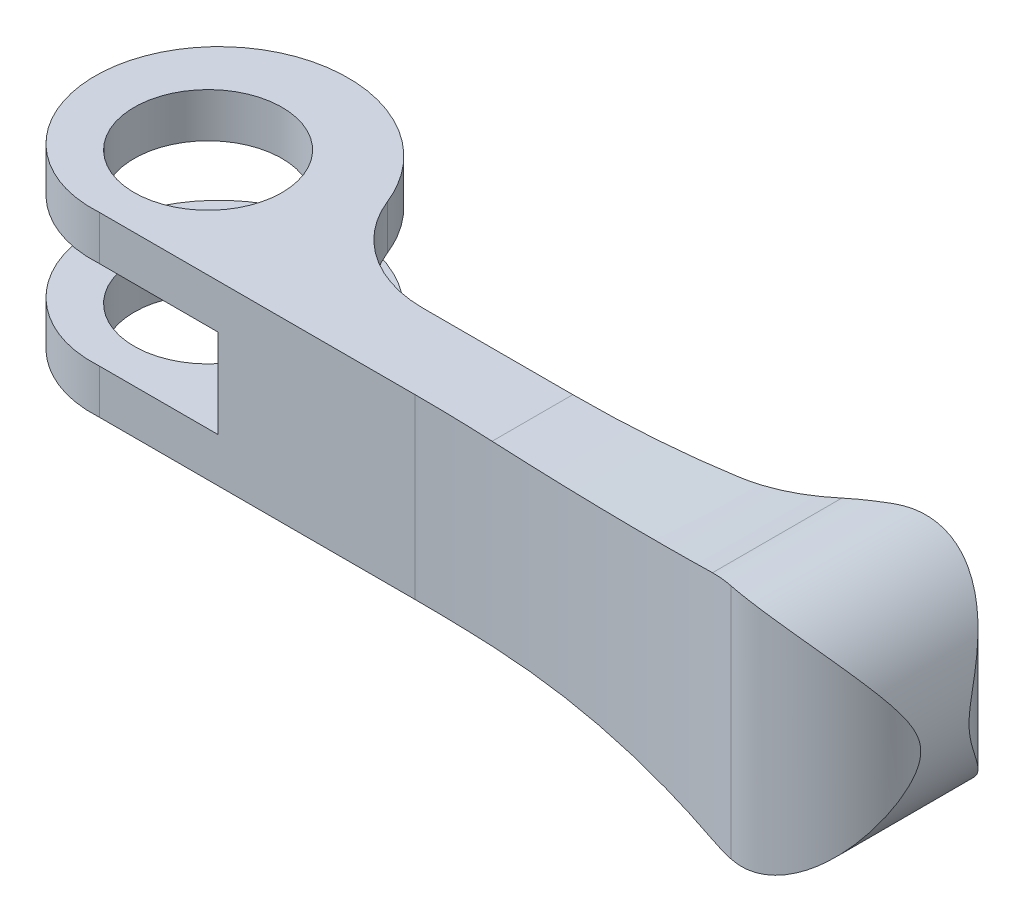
ISO-10303-21;
HEADER;
FILE_DESCRIPTION(('STEP AP214'),'2;1');
FILE_NAME('part.step','',(''),(''),'','','');
FILE_SCHEMA(('AUTOMOTIVE_DESIGN { 1 0 10303 214 1 1 1 1 }'));
ENDSEC;
DATA;
#1=APPLICATION_CONTEXT('core data for automotive mechanical design processes');
#2=APPLICATION_PROTOCOL_DEFINITION('international standard','automotive_design',2000,#1);
#3=PRODUCT_CONTEXT('',#1,'mechanical');
#4=PRODUCT('Part','Part','',(#3));
#5=PRODUCT_RELATED_PRODUCT_CATEGORY('part','',(#4));
#6=PRODUCT_DEFINITION_FORMATION('','',#4);
#7=PRODUCT_DEFINITION_CONTEXT('part definition',#1,'design');
#8=PRODUCT_DEFINITION('design','',#6,#7);
#9=PRODUCT_DEFINITION_SHAPE('','',#8);
#10=(LENGTH_UNIT() NAMED_UNIT(*) SI_UNIT(.MILLI.,.METRE.));
#11=(NAMED_UNIT(*) PLANE_ANGLE_UNIT() SI_UNIT($,.RADIAN.));
#12=(NAMED_UNIT(*) SI_UNIT($,.STERADIAN.) SOLID_ANGLE_UNIT());
#13=UNCERTAINTY_MEASURE_WITH_UNIT(LENGTH_MEASURE(1.E-05),#10,'distance_accuracy_value','');
#14=(GEOMETRIC_REPRESENTATION_CONTEXT(3) GLOBAL_UNCERTAINTY_ASSIGNED_CONTEXT((#13)) GLOBAL_UNIT_ASSIGNED_CONTEXT((#10,
#11,#12)) REPRESENTATION_CONTEXT('',''));
#15=CARTESIAN_POINT('',(0.,0.,0.));
#16=DIRECTION('',(0.,0.,1.));
#17=DIRECTION('',(1.,0.,0.));
#18=AXIS2_PLACEMENT_3D('',#15,#16,#17);
#19=CARTESIAN_POINT('',(32.,-12.,183.));
#20=DIRECTION('',(0.,1.,0.));
#21=DIRECTION('',(1.,0.,0.));
#22=AXIS2_PLACEMENT_3D('',#19,#20,#21);
#23=CYLINDRICAL_SURFACE('',#22,172.);
#24=CARTESIAN_POINT('',(65.4577553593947,11.7276166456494,14.2855115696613));
#25=CARTESIAN_POINT('',(65.6518253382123,11.7696913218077,14.3239954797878));
#26=CARTESIAN_POINT('',(65.8468221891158,11.8069140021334,14.3630148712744));
#27=CARTESIAN_POINT('',(66.2377621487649,11.8715471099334,14.4419534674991));
#28=CARTESIAN_POINT('',(66.4337019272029,11.8989805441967,14.4818703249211));
#29=CARTESIAN_POINT('',(67.0233117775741,11.9667391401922,14.6030598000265));
#30=CARTESIAN_POINT('',(67.4184272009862,11.9924480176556,14.6857029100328));
#31=CARTESIAN_POINT('',(67.813698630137,11.9985537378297,14.7698630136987));
#32=B_SPLINE_CURVE_WITH_KNOTS('',3,(#24,#25,#26,#27,#28,#29,#30,#31),.UNSPECIFIED.,.F.,.F.,(4,2,
2,4),(0.,0.606723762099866,1.2120120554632,2.42366281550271),.UNSPECIFIED.);
#33=CARTESIAN_POINT('',(65.4577553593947,11.7276166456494,14.2855115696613));
#34=VERTEX_POINT('',#33);
#35=CARTESIAN_POINT('',(67.813698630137,11.9985537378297,14.7698630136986));
#36=VERTEX_POINT('',#35);
#37=EDGE_CURVE('E179',#34,#36,#32,.T.);
#38=ORIENTED_EDGE('',*,*,#37,.F.);
#39=CARTESIAN_POINT('',(40.,9.,11.1861472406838));
#40=CARTESIAN_POINT('',(41.0786495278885,8.99998998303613,11.236360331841));
#41=CARTESIAN_POINT('',(42.1568138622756,9.01452328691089,11.2967523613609));
#42=CARTESIAN_POINT('',(44.3110259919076,9.07252358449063,11.4377582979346));
#43=CARTESIAN_POINT('',(45.3870738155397,9.11599018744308,11.5183719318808));
#44=CARTESIAN_POINT('',(47.5315233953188,9.2314665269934,11.6993141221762));
#45=CARTESIAN_POINT('',(48.5999384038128,9.30335830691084,11.7995603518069));
#46=CARTESIAN_POINT('',(50.7323922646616,9.47544657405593,12.0197470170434));
#47=CARTESIAN_POINT('',(51.7964311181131,9.57564305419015,12.1396874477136));
#48=CARTESIAN_POINT('',(54.9804202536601,9.91831356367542,12.5286842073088));
#49=CARTESIAN_POINT('',(57.0925861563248,10.2028872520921,12.8269450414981));
#50=CARTESIAN_POINT('',(60.2423967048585,10.7124052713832,13.3311883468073));
#51=CARTESIAN_POINT('',(61.2914624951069,10.8964990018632,13.50918245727));
#52=CARTESIAN_POINT('',(63.3811325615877,11.2918145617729,13.8836170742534));
#53=CARTESIAN_POINT('',(64.4217370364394,11.5030357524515,14.0800571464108));
#54=CARTESIAN_POINT('',(65.4577553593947,11.7276166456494,14.2855115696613));
#55=B_SPLINE_CURVE_WITH_KNOTS('',3,(#39,#40,#41,#42,#43,#44,#45,#46,#47,#48,#49,#50,#51,#52,#53,
#54),.UNSPECIFIED.,.F.,.F.,(4,2,2,2,2,2,2,4),(0.,3.23928692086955,6.47853009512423,
9.70447004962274,12.9304091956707,19.3812550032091,22.6204269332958,25.8595226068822),.UNSPECIFIED.);
#56=CARTESIAN_POINT('',(40.,9.,11.1861472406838));
#57=VERTEX_POINT('',#56);
#58=EDGE_CURVE('E145',#57,#34,#55,.T.);
#59=ORIENTED_EDGE('',*,*,#58,.F.);
#60=CARTESIAN_POINT('',(32.,9.,183.));
#61=DIRECTION('',(0.,1.,0.));
#62=DIRECTION('',(1.,0.,0.));
#63=AXIS2_PLACEMENT_3D('',#60,#61,#62);
#64=CIRCLE('',#63,172.);
#65=CARTESIAN_POINT('',(32.,9.,11.));
#66=VERTEX_POINT('',#65);
#67=EDGE_CURVE('E154',#66,#57,#64,.F.);
#68=ORIENTED_EDGE('',*,*,#67,.F.);
#69=DIRECTION('',(0.,1.,0.));
#70=VECTOR('',#69,1.);
#71=CARTESIAN_POINT('',(32.,-12.,11.));
#72=LINE('',#71,#70);
#73=CARTESIAN_POINT('',(32.,-9.,11.));
#74=VERTEX_POINT('',#73);
#75=EDGE_CURVE('E301',#74,#66,#72,.T.);
#76=ORIENTED_EDGE('',*,*,#75,.F.);
#77=CARTESIAN_POINT('',(32.,-9.,183.));
#78=DIRECTION('',(0.,1.,0.));
#79=DIRECTION('',(1.,0.,0.));
#80=AXIS2_PLACEMENT_3D('',#77,#78,#79);
#81=CIRCLE('',#80,172.);
#82=CARTESIAN_POINT('',(40.,-9.,11.1861472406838));
#83=VERTEX_POINT('',#82);
#84=EDGE_CURVE('E522',#74,#83,#81,.F.);
#85=ORIENTED_EDGE('',*,*,#84,.T.);
#86=CARTESIAN_POINT('',(40.,-9.,11.1861472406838));
#87=CARTESIAN_POINT('',(41.0786495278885,-8.99998998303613,11.236360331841));
#88=CARTESIAN_POINT('',(42.1568138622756,-9.01452328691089,11.2967523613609));
#89=CARTESIAN_POINT('',(44.3110259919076,-9.07252358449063,11.4377582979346));
#90=CARTESIAN_POINT('',(45.3870738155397,-9.11599018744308,11.5183719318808));
#91=CARTESIAN_POINT('',(47.5315233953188,-9.2314665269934,11.6993141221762));
#92=CARTESIAN_POINT('',(48.5999384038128,-9.30335830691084,11.7995603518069));
#93=CARTESIAN_POINT('',(50.7323922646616,-9.47544657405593,12.0197470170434));
#94=CARTESIAN_POINT('',(51.7964311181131,-9.57564305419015,12.1396874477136));
#95=CARTESIAN_POINT('',(54.9804202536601,-9.91831356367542,12.5286842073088));
#96=CARTESIAN_POINT('',(57.0925861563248,-10.2028872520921,12.8269450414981));
#97=CARTESIAN_POINT('',(60.2423967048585,-10.7124052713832,13.3311883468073));
#98=CARTESIAN_POINT('',(61.2914624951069,-10.8964990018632,13.50918245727));
#99=CARTESIAN_POINT('',(63.3811325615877,-11.2918145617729,13.8836170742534));
#100=CARTESIAN_POINT('',(64.4217370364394,-11.5030357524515,14.0800571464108));
#101=CARTESIAN_POINT('',(65.4577553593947,-11.7276166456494,14.2855115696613));
#102=B_SPLINE_CURVE_WITH_KNOTS('',3,(#86,#87,#88,#89,#90,#91,#92,#93,#94,#95,#96,#97,#98,#99,
#100,#101),.UNSPECIFIED.,.F.,.F.,(4,2,2,2,2,2,2,4),(0.,3.23928692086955,6.47853009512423,
9.70447004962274,12.9304091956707,19.3812550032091,22.6204269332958,25.8595226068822),.UNSPECIFIED.);
#103=CARTESIAN_POINT('',(65.4577553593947,-11.7276166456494,14.2855115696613));
#104=VERTEX_POINT('',#103);
#105=EDGE_CURVE('E516',#83,#104,#102,.T.);
#106=ORIENTED_EDGE('',*,*,#105,.T.);
#107=CARTESIAN_POINT('',(65.4577553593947,-11.7276166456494,14.2855115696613));
#108=CARTESIAN_POINT('',(65.6518253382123,-11.7696913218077,14.3239954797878));
#109=CARTESIAN_POINT('',(65.8468221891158,-11.8069140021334,14.3630148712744));
#110=CARTESIAN_POINT('',(66.2377621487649,-11.8715471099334,14.4419534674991));
#111=CARTESIAN_POINT('',(66.4337019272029,-11.8989805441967,14.4818703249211));
#112=CARTESIAN_POINT('',(67.0233117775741,-11.9667391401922,14.6030598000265));
#113=CARTESIAN_POINT('',(67.4184272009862,-11.9924480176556,14.6857029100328));
#114=CARTESIAN_POINT('',(67.813698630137,-11.9985537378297,14.7698630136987));
#115=B_SPLINE_CURVE_WITH_KNOTS('',3,(#107,#108,#109,#110,#111,#112,#113,#114),.UNSPECIFIED.,.F.,
.F.,(4,2,2,4),(0.,0.606723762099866,1.2120120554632,2.42366281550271),.UNSPECIFIED.);
#116=CARTESIAN_POINT('',(67.813698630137,-11.9985537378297,14.7698630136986));
#117=VERTEX_POINT('',#116);
#118=EDGE_CURVE('E222',#104,#117,#115,.T.);
#119=ORIENTED_EDGE('',*,*,#118,.T.);
#120=DIRECTION('',(0.,1.,0.));
#121=VECTOR('',#120,1.);
#122=CARTESIAN_POINT('',(67.813698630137,-12.,14.7698630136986));
#123=LINE('',#122,#121);
#124=EDGE_CURVE('E284',#117,#36,#123,.T.);
#125=ORIENTED_EDGE('',*,*,#124,.T.);
#126=EDGE_LOOP('',(#38,#59,#68,#76,#85,#106,#119,#125));
#127=FACE_BOUND('',#126,.T.);
#128=ADVANCED_FACE('F14',(#127),#23,.F.);
#129=CARTESIAN_POINT('',(-1.15218884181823E-13,-12.,11.));
#130=DIRECTION('',(0.,0.,-1.));
#131=DIRECTION('',(1.,0.,0.));
#132=AXIS2_PLACEMENT_3D('',#129,#130,#131);
#133=PLANE('',#132);
#134=DIRECTION('',(1.,0.,0.));
#135=VECTOR('',#134,1.);
#136=CARTESIAN_POINT('',(-1.17217041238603E-13,9.,11.));
#137=LINE('',#136,#135);
#138=CARTESIAN_POINT('',(-1.15218884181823E-13,9.,11.));
#139=VERTEX_POINT('',#138);
#140=EDGE_CURVE('E164',#139,#66,#137,.T.);
#141=ORIENTED_EDGE('',*,*,#140,.F.);
#142=DIRECTION('',(0.,1.,0.));
#143=VECTOR('',#142,1.);
#144=CARTESIAN_POINT('',(-1.15218884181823E-13,-12.,11.));
#145=LINE('',#144,#143);
#146=CARTESIAN_POINT('',(-1.15218884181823E-13,4.5,11.));
#147=VERTEX_POINT('',#146);
#148=EDGE_CURVE('E292',#147,#139,#145,.T.);
#149=ORIENTED_EDGE('',*,*,#148,.F.);
#150=DIRECTION('',(1.,0.,0.));
#151=VECTOR('',#150,1.);
#152=CARTESIAN_POINT('',(-1.13133819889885E-13,4.5,11.));
#153=LINE('',#152,#151);
#154=CARTESIAN_POINT('',(12.,4.5,11.));
#155=VERTEX_POINT('',#154);
#156=EDGE_CURVE('E42',#147,#155,#153,.T.);
#157=ORIENTED_EDGE('',*,*,#156,.T.);
#158=DIRECTION('',(0.,-1.,0.));
#159=VECTOR('',#158,1.);
#160=CARTESIAN_POINT('',(12.,-12.,11.));
#161=LINE('',#160,#159);
#162=CARTESIAN_POINT('',(12.,-4.5,11.));
#163=VERTEX_POINT('',#162);
#164=EDGE_CURVE('E365',#155,#163,#161,.T.);
#165=ORIENTED_EDGE('',*,*,#164,.T.);
#166=DIRECTION('',(-1.,0.,0.));
#167=VECTOR('',#166,1.);
#168=CARTESIAN_POINT('',(-1.14271127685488E-13,-4.5,11.));
#169=LINE('',#168,#167);
#170=CARTESIAN_POINT('',(-1.15218884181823E-13,-4.5,11.));
#171=VERTEX_POINT('',#170);
#172=EDGE_CURVE('E359',#163,#171,#169,.T.);
#173=ORIENTED_EDGE('',*,*,#172,.T.);
#174=CARTESIAN_POINT('',(-1.15218884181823E-13,-9.,11.));
#175=VERTEX_POINT('',#174);
#176=EDGE_CURVE('E296',#175,#171,#145,.T.);
#177=ORIENTED_EDGE('',*,*,#176,.F.);
#178=DIRECTION('',(1.,0.,0.));
#179=VECTOR('',#178,1.);
#180=CARTESIAN_POINT('',(-1.14933433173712E-13,-9.,11.));
#181=LINE('',#180,#179);
#182=EDGE_CURVE('E524',#175,#74,#181,.T.);
#183=ORIENTED_EDGE('',*,*,#182,.T.);
#184=ORIENTED_EDGE('',*,*,#75,.T.);
#185=EDGE_LOOP('',(#141,#149,#157,#165,#173,#177,#183,#184));
#186=FACE_BOUND('',#185,.T.);
#187=ADVANCED_FACE('F273',(#186),#133,.F.);
#188=CARTESIAN_POINT('',(-1.15218884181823E-13,-12.,11.));
#189=CARTESIAN_POINT('',(-1.43989663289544,-12.,11.1006875));
#190=CARTESIAN_POINT('',(-2.91975951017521,-12.,10.9148769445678));
#191=CARTESIAN_POINT('',(-5.73046463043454,-12.,9.96861149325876));
#192=CARTESIAN_POINT('',(-7.06008014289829,-12.,9.20823718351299));
#193=CARTESIAN_POINT('',(-9.35063081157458,-12.,7.20247377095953));
#194=CARTESIAN_POINT('',(-10.3104414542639,-12.,5.95765057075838));
#195=CARTESIAN_POINT('',(-11.6893244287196,-12.,3.15495082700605));
#196=CARTESIAN_POINT('',(-12.1075625,-12.,1.59805618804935));
#197=CARTESIAN_POINT('',(-12.3089375,-12.,-1.59805618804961));
#198=CARTESIAN_POINT('',(-12.0916794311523,-12.,-3.23601639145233));
#199=CARTESIAN_POINT('',(-11.0243638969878,-12.,-6.33896226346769));
#200=CARTESIAN_POINT('',(-10.1744346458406,-12.,-7.80260621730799));
#201=CARTESIAN_POINT('',(-7.94499984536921,-12.,-10.3168282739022));
#202=CARTESIAN_POINT('',(-6.56614820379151,-12.,-11.366193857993));
#203=CARTESIAN_POINT('',(-3.47120770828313,-12.,-12.8661269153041));
#204=CARTESIAN_POINT('',(-1.75621574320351,-12.,-13.3158125));
#205=CARTESIAN_POINT('',(1.75621574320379,-12.,-13.5171875));
#206=CARTESIAN_POINT('',(3.55227327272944,-12.,-13.2684819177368));
#207=CARTESIAN_POINT('',(6.94745989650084,-12.,-12.0801163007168));
#208=CARTESIAN_POINT('',(8.54513229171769,-12.,-11.1406321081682));
#209=CARTESIAN_POINT('',(11.2830257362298,-12.,-8.6875259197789));
#210=CARTESIAN_POINT('',(12.421946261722,-12.,-7.17464583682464));
#211=CARTESIAN_POINT('',(14.0429294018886,-12.,-3.78746458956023));
#212=CARTESIAN_POINT('',(14.5240625,-12.,-1.91437529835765));
#213=CARTESIAN_POINT('',(14.7254375,-12.,1.91437529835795));
#214=CARTESIAN_POINT('',(14.4452844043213,-12.,3.86853015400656));
#215=CARTESIAN_POINT('',(13.1358687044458,-12.,7.555957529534));
#216=CARTESIAN_POINT('',(12.1068295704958,-12.,9.28765836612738));
#217=CARTESIAN_POINT('',(9.43005199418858,-12.,12.2492231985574));
#218=CARTESIAN_POINT('',(7.78314346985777,-12.,13.4776986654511));
#219=CARTESIAN_POINT('',(4.10372147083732,-12.,15.2197318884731));
#220=CARTESIAN_POINT('',(2.0725348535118,-12.,15.7323125));
#221=CARTESIAN_POINT('',(-1.6196390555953E-13,-12.,15.833));
#222=B_SPLINE_CURVE_WITH_KNOTS('',3,(#188,#189,#190,#191,#192,#193,#194,#195,#196,#197,#198,
#199,#200,#201,#202,#203,#204,#205,#206,#207,#208,#209,#210,#211,#212,#213,#214,#215,#216,#217,
#218,#219,#220,#221),.UNSPECIFIED.,.F.,.F.,(4,2,2,2,2,2,2,2,2,2,2,2,2,2,2,2,4),(0.,0.0625,0.125,
0.1875,0.25,0.3125,0.375,0.4375,0.5,0.5625,0.625,0.6875,0.75,0.8125,0.875,0.9375,1.),.UNSPECIFIED.);
#223=DIRECTION('',(0.,1.,0.));
#224=VECTOR('',#223,1.);
#225=SURFACE_OF_LINEAR_EXTRUSION('',#222,#224);
#226=CARTESIAN_POINT('',(-1.15218884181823E-13,9.,11.));
#227=CARTESIAN_POINT('',(-1.43989663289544,9.,11.1006875));
#228=CARTESIAN_POINT('',(-2.91975951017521,9.,10.9148769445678));
#229=CARTESIAN_POINT('',(-5.73046463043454,9.,9.96861149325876));
#230=CARTESIAN_POINT('',(-7.06008014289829,9.,9.20823718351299));
#231=CARTESIAN_POINT('',(-9.35063081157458,9.,7.20247377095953));
#232=CARTESIAN_POINT('',(-10.3104414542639,9.,5.95765057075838));
#233=CARTESIAN_POINT('',(-11.6893244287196,9.,3.15495082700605));
#234=CARTESIAN_POINT('',(-12.1075625,9.,1.59805618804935));
#235=CARTESIAN_POINT('',(-12.3089375,9.,-1.59805618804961));
#236=CARTESIAN_POINT('',(-12.0916794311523,9.,-3.23601639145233));
#237=CARTESIAN_POINT('',(-11.0243638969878,9.,-6.33896226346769));
#238=CARTESIAN_POINT('',(-10.1744346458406,9.,-7.80260621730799));
#239=CARTESIAN_POINT('',(-7.94499984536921,9.,-10.3168282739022));
#240=CARTESIAN_POINT('',(-6.56614820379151,9.,-11.366193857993));
#241=CARTESIAN_POINT('',(-3.47120770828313,9.,-12.8661269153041));
#242=CARTESIAN_POINT('',(-1.75621574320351,9.,-13.3158125));
#243=CARTESIAN_POINT('',(1.75621574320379,9.,-13.5171875));
#244=CARTESIAN_POINT('',(3.55227327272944,9.,-13.2684819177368));
#245=CARTESIAN_POINT('',(6.94745989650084,9.,-12.0801163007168));
#246=CARTESIAN_POINT('',(8.54513229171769,9.,-11.1406321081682));
#247=CARTESIAN_POINT('',(11.2830257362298,9.,-8.6875259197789));
#248=CARTESIAN_POINT('',(12.421946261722,9.,-7.17464583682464));
#249=CARTESIAN_POINT('',(14.0429294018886,9.,-3.78746458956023));
#250=CARTESIAN_POINT('',(14.5240625,9.,-1.91437529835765));
#251=CARTESIAN_POINT('',(14.7254375,9.,1.91437529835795));
#252=CARTESIAN_POINT('',(14.4452844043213,9.,3.86853015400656));
#253=CARTESIAN_POINT('',(13.1358687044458,9.,7.555957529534));
#254=CARTESIAN_POINT('',(12.1068295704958,9.,9.28765836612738));
#255=CARTESIAN_POINT('',(9.43005199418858,9.,12.2492231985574));
#256=CARTESIAN_POINT('',(7.78314346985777,9.,13.4776986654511));
#257=CARTESIAN_POINT('',(4.10372147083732,9.,15.2197318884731));
#258=CARTESIAN_POINT('',(2.0725348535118,9.,15.7323125));
#259=CARTESIAN_POINT('',(-1.6196390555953E-13,9.,15.833));
#260=B_SPLINE_CURVE_WITH_KNOTS('',3,(#226,#227,#228,#229,#230,#231,#232,#233,#234,#235,#236,
#237,#238,#239,#240,#241,#242,#243,#244,#245,#246,#247,#248,#249,#250,#251,#252,#253,#254,#255,
#256,#257,#258,#259),.UNSPECIFIED.,.F.,.F.,(4,2,2,2,2,2,2,2,2,2,2,2,2,2,2,2,4),(0.,0.0625,0.125,
0.1875,0.25,0.3125,0.375,0.4375,0.5,0.5625,0.625,0.6875,0.75,0.8125,0.875,0.9375,1.),.UNSPECIFIED.);
#261=CARTESIAN_POINT('',(13.6259439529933,9.,-4.57987700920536));
#262=VERTEX_POINT('',#261);
#263=EDGE_CURVE('E162',#262,#139,#260,.F.);
#264=ORIENTED_EDGE('',*,*,#263,.F.);
#265=DIRECTION('',(0.,1.,0.));
#266=VECTOR('',#265,1.);
#267=CARTESIAN_POINT('',(13.6259439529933,12.,-4.57987700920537));
#268=LINE('',#267,#266);
#269=CARTESIAN_POINT('',(13.6259439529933,4.5,-4.57987700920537));
#270=VERTEX_POINT('',#269);
#271=EDGE_CURVE('E35',#262,#270,#268,.F.);
#272=ORIENTED_EDGE('',*,*,#271,.T.);
#273=CARTESIAN_POINT('',(-1.15218884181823E-13,4.5,11.));
#274=CARTESIAN_POINT('',(-1.43989663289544,4.5,11.1006875));
#275=CARTESIAN_POINT('',(-2.91975951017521,4.5,10.9148769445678));
#276=CARTESIAN_POINT('',(-5.73046463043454,4.5,9.96861149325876));
#277=CARTESIAN_POINT('',(-7.06008014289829,4.5,9.20823718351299));
#278=CARTESIAN_POINT('',(-9.35063081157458,4.5,7.20247377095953));
#279=CARTESIAN_POINT('',(-10.3104414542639,4.5,5.95765057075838));
#280=CARTESIAN_POINT('',(-11.6893244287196,4.5,3.15495082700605));
#281=CARTESIAN_POINT('',(-12.1075625,4.5,1.59805618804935));
#282=CARTESIAN_POINT('',(-12.3089375,4.5,-1.59805618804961));
#283=CARTESIAN_POINT('',(-12.0916794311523,4.5,-3.23601639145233));
#284=CARTESIAN_POINT('',(-11.0243638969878,4.5,-6.33896226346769));
#285=CARTESIAN_POINT('',(-10.1744346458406,4.5,-7.80260621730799));
#286=CARTESIAN_POINT('',(-7.94499984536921,4.5,-10.3168282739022));
#287=CARTESIAN_POINT('',(-6.56614820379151,4.5,-11.366193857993));
#288=CARTESIAN_POINT('',(-3.47120770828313,4.5,-12.8661269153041));
#289=CARTESIAN_POINT('',(-1.75621574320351,4.5,-13.3158125));
#290=CARTESIAN_POINT('',(1.75621574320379,4.5,-13.5171875));
#291=CARTESIAN_POINT('',(3.55227327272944,4.5,-13.2684819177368));
#292=CARTESIAN_POINT('',(6.94745989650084,4.5,-12.0801163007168));
#293=CARTESIAN_POINT('',(8.54513229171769,4.5,-11.1406321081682));
#294=CARTESIAN_POINT('',(11.2830257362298,4.5,-8.6875259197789));
#295=CARTESIAN_POINT('',(12.421946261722,4.5,-7.17464583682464));
#296=CARTESIAN_POINT('',(14.0429294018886,4.5,-3.78746458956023));
#297=CARTESIAN_POINT('',(14.5240625,4.5,-1.91437529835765));
#298=CARTESIAN_POINT('',(14.7254375,4.5,1.91437529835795));
#299=CARTESIAN_POINT('',(14.4452844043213,4.5,3.86853015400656));
#300=CARTESIAN_POINT('',(13.1358687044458,4.5,7.555957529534));
#301=CARTESIAN_POINT('',(12.1068295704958,4.5,9.28765836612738));
#302=CARTESIAN_POINT('',(9.43005199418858,4.5,12.2492231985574));
#303=CARTESIAN_POINT('',(7.78314346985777,4.5,13.4776986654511));
#304=CARTESIAN_POINT('',(4.10372147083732,4.5,15.2197318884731));
#305=CARTESIAN_POINT('',(2.0725348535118,4.5,15.7323125));
#306=CARTESIAN_POINT('',(-1.6196390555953E-13,4.5,15.833));
#307=B_SPLINE_CURVE_WITH_KNOTS('',3,(#273,#274,#275,#276,#277,#278,#279,#280,#281,#282,#283,
#284,#285,#286,#287,#288,#289,#290,#291,#292,#293,#294,#295,#296,#297,#298,#299,#300,#301,#302,
#303,#304,#305,#306),.UNSPECIFIED.,.F.,.F.,(4,2,2,2,2,2,2,2,2,2,2,2,2,2,2,2,4),(0.,0.0625,0.125,
0.1875,0.25,0.3125,0.375,0.4375,0.5,0.5625,0.625,0.6875,0.75,0.8125,0.875,0.9375,1.),.UNSPECIFIED.);
#308=EDGE_CURVE('E307',#270,#147,#307,.F.);
#309=ORIENTED_EDGE('',*,*,#308,.T.);
#310=ORIENTED_EDGE('',*,*,#148,.T.);
#311=EDGE_LOOP('',(#264,#272,#309,#310));
#312=FACE_BOUND('',#311,.T.);
#313=ADVANCED_FACE('F278',(#312),#225,.F.);
#314=CARTESIAN_POINT('',(14.473395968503,-12.,3.));
#315=DIRECTION('',(0.,0.,1.));
#316=DIRECTION('',(-1.,0.,0.));
#317=AXIS2_PLACEMENT_3D('',#314,#315,#316);
#318=PLANE('',#317);
#319=CARTESIAN_POINT('',(40.,129.166666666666,3.));
#320=DIRECTION('',(0.,0.,1.));
#321=DIRECTION('',(-1.,0.,0.));
#322=AXIS2_PLACEMENT_3D('',#319,#320,#321);
#323=CIRCLE('',#322,120.166666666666);
#324=CARTESIAN_POINT('',(56.8754845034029,10.1908464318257,3.));
#325=VERTEX_POINT('',#324);
#326=CARTESIAN_POINT('',(40.,9.,3.));
#327=VERTEX_POINT('',#326);
#328=EDGE_CURVE('E134',#325,#327,#323,.F.);
#329=ORIENTED_EDGE('',*,*,#328,.F.);
#330=DIRECTION('',(0.,1.,0.));
#331=VECTOR('',#330,1.);
#332=CARTESIAN_POINT('',(56.8754845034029,-12.,3.));
#333=LINE('',#332,#331);
#334=CARTESIAN_POINT('',(56.8754845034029,-10.1908464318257,3.));
#335=VERTEX_POINT('',#334);
#336=EDGE_CURVE('E288',#335,#325,#333,.T.);
#337=ORIENTED_EDGE('',*,*,#336,.F.);
#338=CARTESIAN_POINT('',(40.,-129.166666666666,3.));
#339=DIRECTION('',(0.,0.,1.));
#340=DIRECTION('',(-1.,0.,0.));
#341=AXIS2_PLACEMENT_3D('',#338,#339,#340);
#342=CIRCLE('',#341,120.166666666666);
#343=CARTESIAN_POINT('',(40.,-9.,3.));
#344=VERTEX_POINT('',#343);
#345=EDGE_CURVE('E257',#335,#344,#342,.T.);
#346=ORIENTED_EDGE('',*,*,#345,.T.);
#347=DIRECTION('',(-1.,0.,0.));
#348=VECTOR('',#347,1.);
#349=CARTESIAN_POINT('',(14.473395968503,-9.,3.));
#350=LINE('',#349,#348);
#351=CARTESIAN_POINT('',(24.7822207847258,-9.,3.));
#352=VERTEX_POINT('',#351);
#353=EDGE_CURVE('E328',#344,#352,#350,.T.);
#354=ORIENTED_EDGE('',*,*,#353,.T.);
#355=DIRECTION('',(0.,-1.,0.));
#356=VECTOR('',#355,1.);
#357=CARTESIAN_POINT('',(24.7822207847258,12.,3.));
#358=LINE('',#357,#356);
#359=CARTESIAN_POINT('',(24.7822207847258,-4.5,3.));
#360=VERTEX_POINT('',#359);
#361=EDGE_CURVE('E313',#352,#360,#358,.F.);
#362=ORIENTED_EDGE('',*,*,#361,.T.);
#363=DIRECTION('',(-1.,0.,0.));
#364=VECTOR('',#363,1.);
#365=CARTESIAN_POINT('',(30.,-4.5,3.));
#366=LINE('',#365,#364);
#367=CARTESIAN_POINT('',(12.,-4.5,3.));
#368=VERTEX_POINT('',#367);
#369=EDGE_CURVE('E339',#360,#368,#366,.T.);
#370=ORIENTED_EDGE('',*,*,#369,.T.);
#371=DIRECTION('',(0.,1.,0.));
#372=VECTOR('',#371,1.);
#373=CARTESIAN_POINT('',(12.,-4.5,3.));
#374=LINE('',#373,#372);
#375=CARTESIAN_POINT('',(12.,4.5,3.));
#376=VERTEX_POINT('',#375);
#377=EDGE_CURVE('E337',#368,#376,#374,.T.);
#378=ORIENTED_EDGE('',*,*,#377,.T.);
#379=DIRECTION('',(-1.,0.,0.));
#380=VECTOR('',#379,1.);
#381=CARTESIAN_POINT('',(30.,4.5,3.));
#382=LINE('',#381,#380);
#383=CARTESIAN_POINT('',(24.7822207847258,4.5,3.));
#384=VERTEX_POINT('',#383);
#385=EDGE_CURVE('E334',#384,#376,#382,.T.);
#386=ORIENTED_EDGE('',*,*,#385,.F.);
#387=CARTESIAN_POINT('',(24.7822207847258,9.,3.00000000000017));
#388=VERTEX_POINT('',#387);
#389=EDGE_CURVE('E161',#384,#388,#358,.F.);
#390=ORIENTED_EDGE('',*,*,#389,.T.);
#391=DIRECTION('',(-1.,0.,0.));
#392=VECTOR('',#391,1.);
#393=CARTESIAN_POINT('',(14.4733959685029,9.,3.));
#394=LINE('',#393,#392);
#395=EDGE_CURVE('E151',#327,#388,#394,.T.);
#396=ORIENTED_EDGE('',*,*,#395,.F.);
#397=EDGE_LOOP('',(#329,#337,#346,#354,#362,#370,#378,#386,#390,#396));
#398=FACE_BOUND('',#397,.T.);
#399=ADVANCED_FACE('F158',(#398),#318,.F.);
#400=CARTESIAN_POINT('',(56.8754845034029,-12.,-18.));
#401=DIRECTION('',(0.,1.,0.));
#402=DIRECTION('',(1.,0.,0.));
#403=AXIS2_PLACEMENT_3D('',#400,#401,#402);
#404=CYLINDRICAL_SURFACE('',#403,21.);
#405=CARTESIAN_POINT('',(68.7567064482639,11.9761177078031,-0.684210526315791));
#406=CARTESIAN_POINT('',(68.4948872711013,11.9926790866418,-0.504516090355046));
#407=CARTESIAN_POINT('',(68.2285287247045,12.0008685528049,-0.330536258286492));
#408=CARTESIAN_POINT('',(67.6898290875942,11.9989926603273,0.00415230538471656));
#409=CARTESIAN_POINT('',(67.4175318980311,11.9890333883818,0.164932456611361));
#410=CARTESIAN_POINT('',(66.8669276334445,11.9495739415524,0.473514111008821));
#411=CARTESIAN_POINT('',(66.5886197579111,11.9200711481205,0.621313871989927));
#412=CARTESIAN_POINT('',(66.1674255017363,11.8600994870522,0.8330760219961));
#413=CARTESIAN_POINT('',(66.0259771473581,11.8373977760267,0.902198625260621));
#414=CARTESIAN_POINT('',(65.7423486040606,11.7865928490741,1.03689540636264));
#415=CARTESIAN_POINT('',(65.6001683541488,11.7584891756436,1.10246928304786));
#416=CARTESIAN_POINT('',(65.4577553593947,11.7276166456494,1.16623664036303));
#417=B_SPLINE_CURVE_WITH_KNOTS('',3,(#405,#406,#407,#408,#409,#410,#411,#412,#413,#414,#415,
#416),.UNSPECIFIED.,.F.,.F.,(4,2,2,2,2,4),(0.,0.953856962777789,1.9021561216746,2.8505823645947,
3.32765447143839,3.80476700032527),.UNSPECIFIED.);
#418=CARTESIAN_POINT('',(68.7567064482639,11.9761177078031,-0.684210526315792));
#419=VERTEX_POINT('',#418);
#420=CARTESIAN_POINT('',(65.4577553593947,11.7276166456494,1.16623664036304));
#421=VERTEX_POINT('',#420);
#422=EDGE_CURVE('E146',#419,#421,#417,.T.);
#423=ORIENTED_EDGE('',*,*,#422,.F.);
#424=DIRECTION('',(0.,1.,0.));
#425=VECTOR('',#424,1.);
#426=CARTESIAN_POINT('',(68.7567064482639,-12.,-0.684210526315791));
#427=LINE('',#426,#425);
#428=CARTESIAN_POINT('',(68.7567064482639,-11.9761177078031,-0.684210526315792));
#429=VERTEX_POINT('',#428);
#430=EDGE_CURVE('E293',#429,#419,#427,.T.);
#431=ORIENTED_EDGE('',*,*,#430,.F.);
#432=CARTESIAN_POINT('',(68.7567064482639,-11.9761177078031,-0.684210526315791));
#433=CARTESIAN_POINT('',(68.4948872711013,-11.9926790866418,-0.504516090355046));
#434=CARTESIAN_POINT('',(68.2285287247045,-12.0008685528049,-0.330536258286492));
#435=CARTESIAN_POINT('',(67.6898290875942,-11.9989926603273,0.00415230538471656));
#436=CARTESIAN_POINT('',(67.4175318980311,-11.9890333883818,0.164932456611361));
#437=CARTESIAN_POINT('',(66.8669276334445,-11.9495739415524,0.473514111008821));
#438=CARTESIAN_POINT('',(66.5886197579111,-11.9200711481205,0.621313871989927));
#439=CARTESIAN_POINT('',(66.1674255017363,-11.8600994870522,0.8330760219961));
#440=CARTESIAN_POINT('',(66.0259771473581,-11.8373977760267,0.902198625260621));
#441=CARTESIAN_POINT('',(65.7423486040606,-11.7865928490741,1.03689540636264));
#442=CARTESIAN_POINT('',(65.6001683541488,-11.7584891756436,1.10246928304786));
#443=CARTESIAN_POINT('',(65.4577553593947,-11.7276166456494,1.16623664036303));
#444=B_SPLINE_CURVE_WITH_KNOTS('',3,(#432,#433,#434,#435,#436,#437,#438,#439,#440,#441,#442,
#443),.UNSPECIFIED.,.F.,.F.,(4,2,2,2,2,4),(0.,0.953856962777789,1.9021561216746,2.8505823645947,
3.32765447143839,3.80476700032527),.UNSPECIFIED.);
#445=CARTESIAN_POINT('',(65.4577553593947,-11.7276166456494,1.16623664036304));
#446=VERTEX_POINT('',#445);
#447=EDGE_CURVE('E223',#429,#446,#444,.T.);
#448=ORIENTED_EDGE('',*,*,#447,.T.);
#449=CARTESIAN_POINT('',(65.4577553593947,-11.7276166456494,1.16623664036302));
#450=CARTESIAN_POINT('',(65.1855545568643,-11.6686095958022,1.2881213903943));
#451=CARTESIAN_POINT('',(64.9107164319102,-11.6100239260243,1.40422753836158));
#452=CARTESIAN_POINT('',(64.3561498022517,-11.493874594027,1.62469677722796));
#453=CARTESIAN_POINT('',(64.0764211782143,-11.4363109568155,1.72905958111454));
#454=CARTESIAN_POINT('',(63.2302291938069,-11.2653723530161,2.0243388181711));
#455=CARTESIAN_POINT('',(62.6570181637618,-11.1538059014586,2.19733032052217));
#456=CARTESIAN_POINT('',(61.5069991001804,-10.9388645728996,2.49134781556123));
#457=CARTESIAN_POINT('',(60.9304274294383,-10.8353808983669,2.61322608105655));
#458=CARTESIAN_POINT('',(59.768170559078,-10.6356818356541,2.80815067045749));
#459=CARTESIAN_POINT('',(59.1824922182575,-10.5394612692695,2.88123208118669));
#460=CARTESIAN_POINT('',(58.3093493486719,-10.4027038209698,2.95294386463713));
#461=CARTESIAN_POINT('',(58.023815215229,-10.359034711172,2.97053301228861));
#462=CARTESIAN_POINT('',(57.450746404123,-10.27350646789,2.99408577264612));
#463=CARTESIAN_POINT('',(57.163208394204,-10.2316558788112,2.9999993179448));
#464=CARTESIAN_POINT('',(56.8754845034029,-10.1908464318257,3.));
#465=B_SPLINE_CURVE_WITH_KNOTS('',3,(#449,#450,#451,#452,#453,#454,#455,#456,#457,#458,#459,
#460,#461,#462,#463,#464),.UNSPECIFIED.,.F.,.F.,(4,2,2,2,2,2,2,4),(0.,0.911932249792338,
1.82388678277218,3.64865921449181,5.44166281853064,7.23337579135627,8.10133583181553,
8.97300985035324),.UNSPECIFIED.);
#466=EDGE_CURVE('E290',#446,#335,#465,.T.);
#467=ORIENTED_EDGE('',*,*,#466,.T.);
#468=ORIENTED_EDGE('',*,*,#336,.T.);
#469=CARTESIAN_POINT('',(65.4577553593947,11.7276166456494,1.16623664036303));
#470=CARTESIAN_POINT('',(65.1855545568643,11.6686095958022,1.28812139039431));
#471=CARTESIAN_POINT('',(64.9107164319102,11.6100239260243,1.40422753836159));
#472=CARTESIAN_POINT('',(64.3561498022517,11.493874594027,1.62469677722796));
#473=CARTESIAN_POINT('',(64.0764211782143,11.4363109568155,1.72905958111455));
#474=CARTESIAN_POINT('',(63.2302291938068,11.2653723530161,2.02433881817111));
#475=CARTESIAN_POINT('',(62.6570181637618,11.1538059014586,2.19733032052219));
#476=CARTESIAN_POINT('',(61.5069991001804,10.9388645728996,2.49134781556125));
#477=CARTESIAN_POINT('',(60.9304274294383,10.8353808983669,2.61322608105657));
#478=CARTESIAN_POINT('',(59.7681705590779,10.6356818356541,2.8081506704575));
#479=CARTESIAN_POINT('',(59.1824922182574,10.5394612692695,2.8812320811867));
#480=CARTESIAN_POINT('',(58.3093493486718,10.4027038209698,2.95294386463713));
#481=CARTESIAN_POINT('',(58.023815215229,10.359034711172,2.97053301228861));
#482=CARTESIAN_POINT('',(57.450746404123,10.2735064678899,2.99408577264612));
#483=CARTESIAN_POINT('',(57.163208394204,10.2316558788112,2.9999993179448));
#484=CARTESIAN_POINT('',(56.8754845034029,10.1908464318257,3.));
#485=B_SPLINE_CURVE_WITH_KNOTS('',3,(#469,#470,#471,#472,#473,#474,#475,#476,#477,#478,#479,
#480,#481,#482,#483,#484),.UNSPECIFIED.,.F.,.F.,(4,2,2,2,2,2,2,4),(0.,0.911932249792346,
1.8238867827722,3.64865921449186,5.44166281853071,7.23337579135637,8.10133583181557,
8.97300985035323),.UNSPECIFIED.);
#486=EDGE_CURVE('E9',#421,#325,#485,.T.);
#487=ORIENTED_EDGE('',*,*,#486,.F.);
#488=EDGE_LOOP('',(#423,#431,#448,#467,#468,#487));
#489=FACE_BOUND('',#488,.T.);
#490=ADVANCED_FACE('F190',(#489),#404,.F.);
#491=CARTESIAN_POINT('',(73.,-12.,5.5));
#492=DIRECTION('',(0.,1.,0.));
#493=DIRECTION('',(1.,0.,0.));
#494=AXIS2_PLACEMENT_3D('',#491,#492,#493);
#495=CYLINDRICAL_SURFACE('',#494,7.5);
#496=ORIENTED_EDGE('',*,*,#430,.T.);
#497=CARTESIAN_POINT('',(68.7567064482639,11.9761177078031,-0.684210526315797));
#498=CARTESIAN_POINT('',(68.9112030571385,11.9663790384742,-0.790258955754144));
#499=CARTESIAN_POINT('',(69.0695857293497,11.9533480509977,-0.890376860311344));
#500=CARTESIAN_POINT('',(69.3928191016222,11.9199961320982,-1.07822595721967));
#501=CARTESIAN_POINT('',(69.5576705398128,11.8996743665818,-1.16595573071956));
#502=CARTESIAN_POINT('',(69.8920280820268,11.8511062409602,-1.32824865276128));
#503=CARTESIAN_POINT('',(70.0615197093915,11.8228824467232,-1.40284832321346));
#504=CARTESIAN_POINT('',(70.4041262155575,11.7579997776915,-1.53884902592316));
#505=CARTESIAN_POINT('',(70.5772407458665,11.7213417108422,-1.60025132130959));
#506=CARTESIAN_POINT('',(70.9258470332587,11.6392238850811,-1.70980739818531));
#507=CARTESIAN_POINT('',(71.1013418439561,11.5937515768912,-1.75794205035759));
#508=CARTESIAN_POINT('',(71.452949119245,11.4939349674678,-1.84093082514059));
#509=CARTESIAN_POINT('',(71.6290616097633,11.4395902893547,-1.87578438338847));
#510=CARTESIAN_POINT('',(71.9804008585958,11.3221337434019,-1.93250148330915));
#511=CARTESIAN_POINT('',(72.1556277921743,11.2590236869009,-1.95436770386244));
#512=CARTESIAN_POINT('',(72.5038946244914,11.1242886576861,-1.98561622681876));
#513=CARTESIAN_POINT('',(72.6769345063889,11.0526636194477,-1.9949984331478));
#514=CARTESIAN_POINT('',(73.0213195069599,10.9005564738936,-2.0019663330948));
#515=CARTESIAN_POINT('',(73.1926317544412,10.8199949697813,-1.99943636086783));
#516=CARTESIAN_POINT('',(73.5308067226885,10.6510987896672,-1.98310804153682));
#517=CARTESIAN_POINT('',(73.6976695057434,10.5627642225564,-1.96930985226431));
#518=CARTESIAN_POINT('',(74.0262307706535,10.3788250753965,-1.93129979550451));
#519=CARTESIAN_POINT('',(74.1879262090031,10.2832163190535,-1.90708190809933));
#520=CARTESIAN_POINT('',(74.5054473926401,10.085344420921,-1.84912826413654));
#521=CARTESIAN_POINT('',(74.6612718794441,9.98307986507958,-1.8153904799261));
#522=CARTESIAN_POINT('',(75.0394601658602,9.72219222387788,-1.72112262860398));
#523=CARTESIAN_POINT('',(75.2580875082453,9.5599648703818,-1.65549035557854));
#524=CARTESIAN_POINT('',(75.6805804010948,9.22396978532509,-1.50818004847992));
#525=CARTESIAN_POINT('',(75.8844402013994,9.050197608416,-1.42649580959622));
#526=CARTESIAN_POINT('',(76.2773248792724,8.692331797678,-1.24949231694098));
#527=CARTESIAN_POINT('',(76.4663206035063,8.50821903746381,-1.15414725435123));
#528=CARTESIAN_POINT('',(76.828957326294,8.13129301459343,-0.952298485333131));
#529=CARTESIAN_POINT('',(77.0025985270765,7.93847986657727,-0.845794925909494));
#530=CARTESIAN_POINT('',(77.4015250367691,7.46603138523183,-0.579065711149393));
#531=CARTESIAN_POINT('',(77.6194897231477,7.18266876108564,-0.414462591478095));
#532=CARTESIAN_POINT('',(78.0263848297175,6.60281683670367,-0.0727957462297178));
#533=CARTESIAN_POINT('',(78.2152998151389,6.30632066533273,0.104274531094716));
#534=CARTESIAN_POINT('',(78.5649173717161,5.70128416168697,0.465628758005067));
#535=CARTESIAN_POINT('',(78.7256128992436,5.39274084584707,0.649914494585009));
#536=CARTESIAN_POINT('',(79.0194115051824,4.76373066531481,1.01979065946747));
#537=CARTESIAN_POINT('',(79.152527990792,4.4432696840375,1.20538040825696));
#538=CARTESIAN_POINT('',(79.3371059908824,3.93776025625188,1.4868659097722));
#539=CARTESIAN_POINT('',(79.3981516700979,3.75748370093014,1.58512984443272));
#540=CARTESIAN_POINT('',(79.5121035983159,3.3923557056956,1.77776933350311));
#541=CARTESIAN_POINT('',(79.5650112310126,3.20750504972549,1.8721455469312));
#542=CARTESIAN_POINT('',(79.6625437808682,2.83241946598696,2.05453921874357));
#543=CARTESIAN_POINT('',(79.7071665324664,2.64218314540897,2.14255501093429));
#544=CARTESIAN_POINT('',(79.7877404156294,2.25570899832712,2.30859116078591));
#545=CARTESIAN_POINT('',(79.823693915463,2.05947282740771,2.38661424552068));
#546=CARTESIAN_POINT('',(79.9017293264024,1.56183639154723,2.56241994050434));
#547=CARTESIAN_POINT('',(79.9381920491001,1.25599112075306,2.65117149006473));
#548=CARTESIAN_POINT('',(79.975061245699,0.788768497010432,2.74325667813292));
#549=CARTESIAN_POINT('',(79.9843785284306,0.632128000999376,2.767100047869));
#550=CARTESIAN_POINT('',(79.9968469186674,0.31699058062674,2.79917793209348));
#551=CARTESIAN_POINT('',(79.9999998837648,0.158494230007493,2.80741714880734));
#552=CARTESIAN_POINT('',(80.0000001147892,-0.156522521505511,2.8074180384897));
#553=CARTESIAN_POINT('',(79.9969253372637,-0.313042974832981,2.79938342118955));
#554=CARTESIAN_POINT('',(79.9847633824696,-0.624296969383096,2.76808673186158));
#555=CARTESIAN_POINT('',(79.975674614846,-0.779030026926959,2.74482063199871));
#556=CARTESIAN_POINT('',(79.9396926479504,-1.24071021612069,2.654859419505));
#557=CARTESIAN_POINT('',(79.9040902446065,-1.54304849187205,2.56804611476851));
#558=CARTESIAN_POINT('',(79.8178587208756,-2.099767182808,2.37321688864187));
#559=CARTESIAN_POINT('',(79.7693080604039,-2.3557689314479,2.26857440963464));
#560=CARTESIAN_POINT('',(79.6575369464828,-2.8579564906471,2.04413665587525));
#561=CARTESIAN_POINT('',(79.5943016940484,-3.10413210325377,1.92432615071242));
#562=CARTESIAN_POINT('',(79.4536884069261,-3.58841244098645,1.6763526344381));
#563=CARTESIAN_POINT('',(79.3762919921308,-3.82650619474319,1.54817890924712));
#564=CARTESIAN_POINT('',(79.2076178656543,-4.29550190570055,1.28816916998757));
#565=CARTESIAN_POINT('',(79.1163459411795,-4.52640681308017,1.15633470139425));
#566=CARTESIAN_POINT('',(78.9021008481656,-5.02293901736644,0.868264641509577));
#567=CARTESIAN_POINT('',(78.7763790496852,-5.28731934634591,0.711915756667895));
#568=CARTESIAN_POINT('',(78.5050923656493,-5.8076783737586,0.402316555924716));
#569=CARTESIAN_POINT('',(78.3595230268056,-6.06365517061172,0.249066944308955));
#570=CARTESIAN_POINT('',(78.0482772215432,-6.5665344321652,-0.0508119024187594));
#571=CARTESIAN_POINT('',(77.8826316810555,-6.81345010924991,-0.197450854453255));
#572=CARTESIAN_POINT('',(77.5306688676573,-7.29767180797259,-0.481152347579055));
#573=CARTESIAN_POINT('',(77.344356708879,-7.53498018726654,-0.618217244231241));
#574=CARTESIAN_POINT('',(76.8295292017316,-8.14125501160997,-0.959877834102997));
#575=CARTESIAN_POINT('',(76.4838109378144,-8.5018336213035,-1.15441495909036));
#576=CARTESIAN_POINT('',(75.9239935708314,-9.01523939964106,-1.40958333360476));
#577=CARTESIAN_POINT('',(75.7305106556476,-9.18180034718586,-1.48853431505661));
#578=CARTESIAN_POINT('',(75.3299871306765,-9.50459594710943,-1.63206631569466));
#579=CARTESIAN_POINT('',(75.1229494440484,-9.66083281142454,-1.69665042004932));
#580=CARTESIAN_POINT('',(74.7380663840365,-9.93189180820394,-1.79798423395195));
#581=CARTESIAN_POINT('',(74.5624806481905,-10.0488186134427,-1.83770974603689));
#582=CARTESIAN_POINT('',(74.2037132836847,-10.2741804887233,-1.90502307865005));
#583=CARTESIAN_POINT('',(74.0205334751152,-10.3826175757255,-1.93261378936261));
#584=CARTESIAN_POINT('',(73.6475868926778,-10.5901020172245,-1.97434346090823));
#585=CARTESIAN_POINT('',(73.4578247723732,-10.6891558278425,-1.98849173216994));
#586=CARTESIAN_POINT('',(73.0728145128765,-10.8771520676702,-2.00211939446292));
#587=CARTESIAN_POINT('',(72.8775664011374,-10.9660945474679,-2.00159885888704));
#588=CARTESIAN_POINT('',(72.4815476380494,-11.1338372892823,-1.98470380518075));
#589=CARTESIAN_POINT('',(72.2807452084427,-11.2125502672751,-1.96820186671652));
#590=CARTESIAN_POINT('',(71.8770430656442,-11.3584596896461,-1.91824351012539));
#591=CARTESIAN_POINT('',(71.6741432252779,-11.4256554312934,-1.88478605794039));
#592=CARTESIAN_POINT('',(71.2684370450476,-11.5482554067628,-1.80031471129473));
#593=CARTESIAN_POINT('',(71.0656306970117,-11.6036610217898,-1.74930287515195));
#594=CARTESIAN_POINT('',(70.6625146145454,-11.7027404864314,-1.6295446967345));
#595=CARTESIAN_POINT('',(70.4622041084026,-11.7464180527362,-1.56080398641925));
#596=CARTESIAN_POINT('',(70.001130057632,-11.8349930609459,-1.38014739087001));
#597=CARTESIAN_POINT('',(69.7421252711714,-11.8755772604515,-1.26146647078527));
#598=CARTESIAN_POINT('',(69.3640600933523,-11.9229007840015,-1.06127698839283));
#599=CARTESIAN_POINT('',(69.2397933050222,-11.9364156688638,-0.990862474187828));
#600=CARTESIAN_POINT('',(68.9951828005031,-11.9592927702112,-0.842858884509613));
#601=CARTESIAN_POINT('',(68.8748397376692,-11.968654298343,-0.7652686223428));
#602=CARTESIAN_POINT('',(68.7567064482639,-11.9761177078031,-0.684210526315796));
#603=B_SPLINE_CURVE_WITH_KNOTS('',3,(#497,#498,#499,#500,#501,#502,#503,#504,#505,#506,#507,
#508,#509,#510,#511,#512,#513,#514,#515,#516,#517,#518,#519,#520,#521,#522,#523,#524,#525,#526,
#527,#528,#529,#530,#531,#532,#533,#534,#535,#536,#537,#538,#539,#540,#541,#542,#543,#544,#545,
#546,#547,#548,#549,#550,#551,#552,#553,#554,#555,#556,#557,#558,#559,#560,#561,#562,#563,#564,
#565,#566,#567,#568,#569,#570,#571,#572,#573,#574,#575,#576,#577,#578,#579,#580,#581,#582,#583,
#584,#585,#586,#587,#588,#589,#590,#591,#592,#593,#594,#595,#596,#597,#598,#599,#600,#601,#602),
.UNSPECIFIED.,.F.,.F.,(4,2,2,2,2,2,2,2,2,2,2,2,2,2,2,2,2,2,2,2,2,2,2,2,2,2,2,2,2,2,2,2,2,2,2,2,
2,2,2,2,2,2,2,2,2,2,2,2,2,2,2,2,4),(0.,0.562800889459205,1.12566618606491,1.68694021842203,
2.24816050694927,2.81018578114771,3.37223493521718,3.93416811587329,4.49610562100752,
5.06351066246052,5.6309077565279,6.19863310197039,6.76647945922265,7.60533450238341,
8.444514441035,9.28530124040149,10.1260769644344,11.3050398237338,12.4846269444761,
13.6645080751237,14.8438142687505,15.4862255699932,16.1285275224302,16.770997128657,
17.4132910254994,18.3700809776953,18.8454730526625,19.3207218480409,19.7900584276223,
20.259519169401,21.204600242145,22.0459402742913,22.888131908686,23.7314244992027,
24.5743663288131,25.5693103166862,26.5644779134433,27.5581315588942,28.5515398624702,
30.153414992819,30.954380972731,31.7551747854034,32.3985859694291,33.0418438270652,
33.6846558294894,34.3274646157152,34.9754410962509,35.6234570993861,36.2713971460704,
36.9191316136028,37.7796616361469,38.2098211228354,38.6400518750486),.UNSPECIFIED.);
#604=EDGE_CURVE('E250',#419,#429,#603,.T.);
#605=ORIENTED_EDGE('',*,*,#604,.T.);
#606=EDGE_LOOP('',(#496,#605));
#607=FACE_BOUND('',#606,.T.);
#608=ADVANCED_FACE('F259',(#607),#495,.T.);
#609=CARTESIAN_POINT('',(70.,-12.,4.5));
#610=DIRECTION('',(0.,1.,0.));
#611=DIRECTION('',(1.,0.,0.));
#612=AXIS2_PLACEMENT_3D('',#609,#610,#611);
#613=CYLINDRICAL_SURFACE('',#612,10.5);
#614=CARTESIAN_POINT('',(67.813698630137,-11.9985537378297,14.7698630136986));
#615=CARTESIAN_POINT('',(67.9292091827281,-12.0003485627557,14.7944546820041));
#616=CARTESIAN_POINT('',(68.0451458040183,-12.0004784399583,14.8170969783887));
#617=CARTESIAN_POINT('',(68.2776723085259,-11.9973503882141,14.8584521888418));
#618=CARTESIAN_POINT('',(68.3942621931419,-11.994092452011,14.8771650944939));
#619=CARTESIAN_POINT('',(68.7445977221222,-11.979154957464,14.9273471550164));
#620=CARTESIAN_POINT('',(68.9790233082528,-11.9623135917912,14.952883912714));
#621=CARTESIAN_POINT('',(69.4461844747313,-11.9148380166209,14.9879859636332));
#622=CARTESIAN_POINT('',(69.6789216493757,-11.8842884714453,14.9976476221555));
#623=CARTESIAN_POINT('',(70.1423263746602,-11.8095517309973,15.0015915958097));
#624=CARTESIAN_POINT('',(70.3729939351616,-11.7653646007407,14.9958739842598));
#625=CARTESIAN_POINT('',(70.8303520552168,-11.663787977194,14.9696204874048));
#626=CARTESIAN_POINT('',(71.0570454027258,-11.6064081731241,14.9490954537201));
#627=CARTESIAN_POINT('',(71.5052047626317,-11.4790173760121,14.8940059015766));
#628=CARTESIAN_POINT('',(71.7266684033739,-11.4090007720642,14.8594351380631));
#629=CARTESIAN_POINT('',(72.1631723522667,-11.2570622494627,14.7771619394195));
#630=CARTESIAN_POINT('',(72.3782070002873,-11.1751301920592,14.7294482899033));
#631=CARTESIAN_POINT('',(72.8006667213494,-11.0002678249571,14.6219464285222));
#632=CARTESIAN_POINT('',(73.0080902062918,-10.9073352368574,14.5621557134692));
#633=CARTESIAN_POINT('',(73.4755029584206,-10.6819870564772,14.4120052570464));
#634=CARTESIAN_POINT('',(73.7326043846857,-10.5460881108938,14.3178551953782));
#635=CARTESIAN_POINT('',(74.2314972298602,-10.2592062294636,14.1133847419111));
#636=CARTESIAN_POINT('',(74.473284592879,-10.1082193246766,14.0030600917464));
#637=CARTESIAN_POINT('',(74.9412619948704,-9.79278416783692,13.768362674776));
#638=CARTESIAN_POINT('',(75.1674291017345,-9.62831686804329,13.6439699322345));
#639=CARTESIAN_POINT('',(75.603563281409,-9.28775524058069,13.3833904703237));
#640=CARTESIAN_POINT('',(75.8135298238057,-9.11166053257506,13.2472033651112));
#641=CARTESIAN_POINT('',(76.2912118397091,-8.68292147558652,12.9133136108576));
#642=CARTESIAN_POINT('',(76.5519638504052,-8.42583433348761,12.7113287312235));
#643=CARTESIAN_POINT('',(77.0440294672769,-7.89534881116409,12.2933257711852));
#644=CARTESIAN_POINT('',(77.2753302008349,-7.62194337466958,12.0773016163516));
#645=CARTESIAN_POINT('',(77.7095863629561,-7.06045913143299,11.6350155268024));
#646=CARTESIAN_POINT('',(77.9124999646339,-6.77235950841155,11.4087391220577));
#647=CARTESIAN_POINT('',(78.2904161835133,-6.18303238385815,10.9503592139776));
#648=CARTESIAN_POINT('',(78.4654280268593,-5.88180926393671,10.7182576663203));
#649=CARTESIAN_POINT('',(78.7522966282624,-5.33488366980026,10.304801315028));
#650=CARTESIAN_POINT('',(78.8695301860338,-5.09179873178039,10.1236849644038));
#651=CARTESIAN_POINT('',(79.0879190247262,-4.59687631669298,9.76346424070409));
#652=CARTESIAN_POINT('',(79.189068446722,-4.34503569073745,9.58436062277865));
#653=CARTESIAN_POINT('',(79.3750793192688,-3.83171400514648,9.23258482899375));
#654=CARTESIAN_POINT('',(79.4599686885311,-3.57025040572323,9.05990204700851));
#655=CARTESIAN_POINT('',(79.6132260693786,-3.03487515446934,8.72720453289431));
#656=CARTESIAN_POINT('',(79.6816112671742,-2.76097680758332,8.56717674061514));
#657=CARTESIAN_POINT('',(79.7939649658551,-2.22885021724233,8.28790265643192));
#658=CARTESIAN_POINT('',(79.8398298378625,-1.97240367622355,8.16608621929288));
#659=CARTESIAN_POINT('',(79.9157300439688,-1.44422914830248,7.95556056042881));
#660=CARTESIAN_POINT('',(79.9458309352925,-1.17256973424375,7.86671468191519));
#661=CARTESIAN_POINT('',(79.9775795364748,-0.74780148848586,7.77095432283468));
#662=CARTESIAN_POINT('',(79.9859511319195,-0.599485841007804,7.74516509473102));
#663=CARTESIAN_POINT('',(79.9971580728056,-0.300776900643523,7.7104794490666));
#664=CARTESIAN_POINT('',(79.9999997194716,-0.150386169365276,7.70156380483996));
#665=CARTESIAN_POINT('',(80.0000002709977,0.145276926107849,7.70156048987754));
#666=CARTESIAN_POINT('',(79.9973489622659,0.290549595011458,7.70987741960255));
#667=CARTESIAN_POINT('',(79.9868869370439,0.579179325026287,7.7422784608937));
#668=CARTESIAN_POINT('',(79.9790723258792,0.722534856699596,7.76637447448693));
#669=CARTESIAN_POINT('',(79.9482683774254,1.14905903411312,7.85949341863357));
#670=CARTESIAN_POINT('',(79.9179244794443,1.42714632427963,7.94931079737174));
#671=CARTESIAN_POINT('',(79.847142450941,1.92298115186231,8.14593285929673));
#672=CARTESIAN_POINT('',(79.8090995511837,2.14325916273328,8.24771251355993));
#673=CARTESIAN_POINT('',(79.7226952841,2.5742223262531,8.46649454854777));
#674=CARTESIAN_POINT('',(79.6743237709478,2.7848977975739,8.58351185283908));
#675=CARTESIAN_POINT('',(79.5677959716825,3.19873574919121,8.82724483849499));
#676=CARTESIAN_POINT('',(79.5096115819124,3.40187454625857,8.9539877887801));
#677=CARTESIAN_POINT('',(79.3838919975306,3.80142288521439,9.21310130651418));
#678=CARTESIAN_POINT('',(79.3163599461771,3.99783466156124,9.34546997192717));
#679=CARTESIAN_POINT('',(79.1736926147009,4.38056365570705,9.61033074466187));
#680=CARTESIAN_POINT('',(79.0987663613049,4.56700898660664,9.74275089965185));
#681=CARTESIAN_POINT('',(78.9400723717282,4.93507432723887,10.0090069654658));
#682=CARTESIAN_POINT('',(78.8563035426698,5.11669373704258,10.1428430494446));
#683=CARTESIAN_POINT('',(78.5915213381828,5.6550764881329,10.5447157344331));
#684=CARTESIAN_POINT('',(78.3970967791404,6.00519170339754,10.8129942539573));
#685=CARTESIAN_POINT('',(77.9720444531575,6.6872504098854,11.3418989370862));
#686=CARTESIAN_POINT('',(77.7414986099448,7.01923278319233,11.6025408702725));
#687=CARTESIAN_POINT('',(77.242617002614,7.6642053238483,12.1105920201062));
#688=CARTESIAN_POINT('',(76.974308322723,7.97720887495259,12.3580105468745));
#689=CARTESIAN_POINT('',(76.4974049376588,8.47756988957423,12.7519028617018));
#690=CARTESIAN_POINT('',(76.299891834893,8.67120137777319,12.9038936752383));
#691=CARTESIAN_POINT('',(75.8877115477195,9.04775730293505,13.1976361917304));
#692=CARTESIAN_POINT('',(75.6730452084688,9.23068226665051,13.3393883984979));
#693=CARTESIAN_POINT('',(75.2267614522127,9.58409282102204,13.6103808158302));
#694=CARTESIAN_POINT('',(74.9951652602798,9.75459346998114,13.7396362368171));
#695=CARTESIAN_POINT('',(74.5150018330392,10.0816205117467,13.9835238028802));
#696=CARTESIAN_POINT('',(74.2664379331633,10.2381496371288,14.0981588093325));
#697=CARTESIAN_POINT('',(73.801955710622,10.5068996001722,14.2900805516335));
#698=CARTESIAN_POINT('',(73.5888499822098,10.6218779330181,14.3703208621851));
#699=CARTESIAN_POINT('',(73.1525736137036,10.8402239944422,14.5181986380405));
#700=CARTESIAN_POINT('',(72.9294052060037,10.9435942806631,14.585838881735));
#701=CARTESIAN_POINT('',(72.4738421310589,11.1375954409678,14.7071381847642));
#702=CARTESIAN_POINT('',(72.2414459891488,11.2282242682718,14.7607949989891));
#703=CARTESIAN_POINT('',(71.7687256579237,11.3955939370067,14.8527569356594));
#704=CARTESIAN_POINT('',(71.5284017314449,11.4723352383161,14.8910625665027));
#705=CARTESIAN_POINT('',(71.0394854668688,11.6114872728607,14.9513451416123));
#706=CARTESIAN_POINT('',(70.7908421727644,11.6737777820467,14.9731882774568));
#707=CARTESIAN_POINT('',(70.2891160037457,11.7824372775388,14.9990240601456));
#708=CARTESIAN_POINT('',(70.0360323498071,11.8288034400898,15.0030135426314));
#709=CARTESIAN_POINT('',(69.5283422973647,11.9050380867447,14.9924676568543));
#710=CARTESIAN_POINT('',(69.2737403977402,11.9349421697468,14.9779724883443));
#711=CARTESIAN_POINT('',(68.7650309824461,11.9783054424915,14.9302455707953));
#712=CARTESIAN_POINT('',(68.5109232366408,11.99177734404,14.8970283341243));
#713=CARTESIAN_POINT('',(68.1838864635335,11.9988228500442,14.8420234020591));
#714=CARTESIAN_POINT('',(68.1095806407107,11.9997291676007,14.8286989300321));
#715=CARTESIAN_POINT('',(67.9613599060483,12.0001659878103,14.8004671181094));
#716=CARTESIAN_POINT('',(67.8874446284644,11.9996981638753,14.7855617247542));
#717=CARTESIAN_POINT('',(67.813698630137,11.9985537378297,14.7698630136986));
#718=B_SPLINE_CURVE_WITH_KNOTS('',3,(#614,#615,#616,#617,#618,#619,#620,#621,#622,#623,#624,
#625,#626,#627,#628,#629,#630,#631,#632,#633,#634,#635,#636,#637,#638,#639,#640,#641,#642,#643,
#644,#645,#646,#647,#648,#649,#650,#651,#652,#653,#654,#655,#656,#657,#658,#659,#660,#661,#662,
#663,#664,#665,#666,#667,#668,#669,#670,#671,#672,#673,#674,#675,#676,#677,#678,#679,#680,#681,
#682,#683,#684,#685,#686,#687,#688,#689,#690,#691,#692,#693,#694,#695,#696,#697,#698,#699,#700,
#701,#702,#703,#704,#705,#706,#707,#708,#709,#710,#711,#712,#713,#714,#715,#716,#717),
.UNSPECIFIED.,.F.,.F.,(4,2,2,2,2,2,2,2,2,2,2,2,2,2,2,2,2,2,2,2,2,2,2,2,2,2,2,2,2,2,2,2,2,2,2,2,
2,2,2,2,2,2,2,2,2,2,2,2,2,2,2,4),(0.,0.354280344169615,0.70856144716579,1.41677500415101,
2.12067345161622,2.82456854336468,3.52794830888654,4.23164115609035,4.93593631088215,
5.64037759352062,6.55604795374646,7.47195982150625,8.38918894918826,9.30644809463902,
10.5591686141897,11.8124348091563,13.0675286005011,14.3222065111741,15.296787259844,
16.2717222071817,17.2449678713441,18.2171956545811,19.0784127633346,19.9360193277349,
20.3874241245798,20.8383142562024,21.273885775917,21.7097862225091,22.58610795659,
23.3220700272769,24.0587583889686,24.7975935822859,25.5361809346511,26.2578892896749,
26.9796869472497,28.4239441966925,29.8649720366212,31.3049715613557,32.2510831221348,
33.1971480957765,34.1420466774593,35.0867600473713,35.8513361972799,36.6157435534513,
37.3802735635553,38.1447782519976,38.9154317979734,39.6862219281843,40.4553386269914,
41.2238599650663,41.4503295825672,41.6765235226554),.UNSPECIFIED.);
#719=EDGE_CURVE('E212',#117,#36,#718,.T.);
#720=ORIENTED_EDGE('',*,*,#719,.T.);
#721=ORIENTED_EDGE('',*,*,#124,.F.);
#722=EDGE_LOOP('',(#720,#721));
#723=FACE_BOUND('',#722,.T.);
#724=ADVANCED_FACE('F229',(#723),#613,.T.);
#725=CARTESIAN_POINT('',(0.,12.,0.));
#726=DIRECTION('',(0.,-1.,0.));
#727=DIRECTION('',(-1.,0.,0.));
#728=AXIS2_PLACEMENT_3D('',#725,#726,#727);
#729=CYLINDRICAL_SURFACE('',#728,7.5);
#730=CARTESIAN_POINT('',(0.,4.5,0.));
#731=DIRECTION('',(0.,1.,0.));
#732=DIRECTION('',(1.,0.,0.));
#733=AXIS2_PLACEMENT_3D('',#730,#731,#732);
#734=CIRCLE('',#733,7.5);
#735=CARTESIAN_POINT('',(7.5,4.5,0.));
#736=VERTEX_POINT('',#735);
#737=EDGE_CURVE('E304',#736,#736,#734,.F.);
#738=ORIENTED_EDGE('',*,*,#737,.T.);
#739=EDGE_LOOP('',(#738));
#740=FACE_BOUND('',#739,.T.);
#741=CARTESIAN_POINT('',(0.,9.,0.));
#742=DIRECTION('',(0.,1.,0.));
#743=DIRECTION('',(1.,0.,0.));
#744=AXIS2_PLACEMENT_3D('',#741,#742,#743);
#745=CIRCLE('',#744,7.5);
#746=CARTESIAN_POINT('',(7.5,9.,0.));
#747=VERTEX_POINT('',#746);
#748=EDGE_CURVE('E176',#747,#747,#745,.F.);
#749=ORIENTED_EDGE('',*,*,#748,.F.);
#750=EDGE_LOOP('',(#749));
#751=FACE_BOUND('',#750,.T.);
#752=ADVANCED_FACE('F268',(#740,#751),#729,.F.);
#753=CARTESIAN_POINT('',(24.7822207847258,0.,-8.99999999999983));
#754=DIRECTION('',(0.,1.,0.));
#755=DIRECTION('',(1.,0.,0.));
#756=AXIS2_PLACEMENT_3D('',#753,#754,#755);
#757=CYLINDRICAL_SURFACE('',#756,12.);
#758=CARTESIAN_POINT('',(24.7822207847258,9.,-8.99999999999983));
#759=DIRECTION('',(0.,1.,0.));
#760=DIRECTION('',(1.,0.,0.));
#761=AXIS2_PLACEMENT_3D('',#758,#759,#760);
#762=CIRCLE('',#761,12.);
#763=EDGE_CURVE('E28',#388,#262,#762,.F.);
#764=ORIENTED_EDGE('',*,*,#763,.F.);
#765=ORIENTED_EDGE('',*,*,#389,.F.);
#766=CARTESIAN_POINT('',(24.7822207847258,4.5,-8.99999999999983));
#767=DIRECTION('',(0.,1.,0.));
#768=DIRECTION('',(1.,0.,0.));
#769=AXIS2_PLACEMENT_3D('',#766,#767,#768);
#770=CIRCLE('',#769,12.);
#771=EDGE_CURVE('E317',#384,#270,#770,.F.);
#772=ORIENTED_EDGE('',*,*,#771,.T.);
#773=ORIENTED_EDGE('',*,*,#271,.F.);
#774=EDGE_LOOP('',(#764,#765,#772,#773));
#775=FACE_BOUND('',#774,.T.);
#776=ADVANCED_FACE('F239',(#775),#757,.F.);
#777=CARTESIAN_POINT('',(13.6259439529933,-4.5,-4.57987700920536));
#778=VERTEX_POINT('',#777);
#779=CARTESIAN_POINT('',(13.6259439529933,-9.,-4.57987700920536));
#780=VERTEX_POINT('',#779);
#781=EDGE_CURVE('E315',#778,#780,#268,.F.);
#782=ORIENTED_EDGE('',*,*,#781,.T.);
#783=CARTESIAN_POINT('',(-1.15218884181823E-13,-9.,11.));
#784=CARTESIAN_POINT('',(-1.43989663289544,-9.,11.1006875));
#785=CARTESIAN_POINT('',(-2.91975951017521,-9.,10.9148769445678));
#786=CARTESIAN_POINT('',(-5.73046463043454,-9.,9.96861149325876));
#787=CARTESIAN_POINT('',(-7.06008014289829,-9.,9.20823718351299));
#788=CARTESIAN_POINT('',(-9.35063081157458,-9.,7.20247377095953));
#789=CARTESIAN_POINT('',(-10.3104414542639,-9.,5.95765057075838));
#790=CARTESIAN_POINT('',(-11.6893244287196,-9.,3.15495082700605));
#791=CARTESIAN_POINT('',(-12.1075625,-9.,1.59805618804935));
#792=CARTESIAN_POINT('',(-12.3089375,-9.,-1.59805618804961));
#793=CARTESIAN_POINT('',(-12.0916794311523,-9.,-3.23601639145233));
#794=CARTESIAN_POINT('',(-11.0243638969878,-9.,-6.33896226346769));
#795=CARTESIAN_POINT('',(-10.1744346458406,-9.,-7.80260621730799));
#796=CARTESIAN_POINT('',(-7.94499984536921,-9.,-10.3168282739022));
#797=CARTESIAN_POINT('',(-6.56614820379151,-9.,-11.366193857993));
#798=CARTESIAN_POINT('',(-3.47120770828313,-9.,-12.8661269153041));
#799=CARTESIAN_POINT('',(-1.75621574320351,-9.,-13.3158125));
#800=CARTESIAN_POINT('',(1.75621574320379,-9.,-13.5171875));
#801=CARTESIAN_POINT('',(3.55227327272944,-9.,-13.2684819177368));
#802=CARTESIAN_POINT('',(6.94745989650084,-9.,-12.0801163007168));
#803=CARTESIAN_POINT('',(8.54513229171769,-9.,-11.1406321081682));
#804=CARTESIAN_POINT('',(11.2830257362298,-9.,-8.6875259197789));
#805=CARTESIAN_POINT('',(12.421946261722,-9.,-7.17464583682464));
#806=CARTESIAN_POINT('',(14.0429294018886,-9.,-3.78746458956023));
#807=CARTESIAN_POINT('',(14.5240625,-9.,-1.91437529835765));
#808=CARTESIAN_POINT('',(14.7254375,-9.,1.91437529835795));
#809=CARTESIAN_POINT('',(14.4452844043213,-9.,3.86853015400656));
#810=CARTESIAN_POINT('',(13.1358687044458,-9.,7.555957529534));
#811=CARTESIAN_POINT('',(12.1068295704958,-9.,9.28765836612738));
#812=CARTESIAN_POINT('',(9.43005199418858,-9.,12.2492231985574));
#813=CARTESIAN_POINT('',(7.78314346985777,-9.,13.4776986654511));
#814=CARTESIAN_POINT('',(4.10372147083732,-9.,15.2197318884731));
#815=CARTESIAN_POINT('',(2.0725348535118,-9.,15.7323125));
#816=CARTESIAN_POINT('',(-1.6196390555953E-13,-9.,15.833));
#817=B_SPLINE_CURVE_WITH_KNOTS('',3,(#783,#784,#785,#786,#787,#788,#789,#790,#791,#792,#793,
#794,#795,#796,#797,#798,#799,#800,#801,#802,#803,#804,#805,#806,#807,#808,#809,#810,#811,#812,
#813,#814,#815,#816),.UNSPECIFIED.,.F.,.F.,(4,2,2,2,2,2,2,2,2,2,2,2,2,2,2,2,4),(0.,0.0625,0.125,
0.1875,0.25,0.3125,0.375,0.4375,0.5,0.5625,0.625,0.6875,0.75,0.8125,0.875,0.9375,1.),.UNSPECIFIED.);
#818=EDGE_CURVE('E528',#780,#175,#817,.F.);
#819=ORIENTED_EDGE('',*,*,#818,.T.);
#820=ORIENTED_EDGE('',*,*,#176,.T.);
#821=CARTESIAN_POINT('',(-1.15218884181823E-13,-4.5,11.));
#822=CARTESIAN_POINT('',(-1.43989663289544,-4.5,11.1006875));
#823=CARTESIAN_POINT('',(-2.91975951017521,-4.5,10.9148769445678));
#824=CARTESIAN_POINT('',(-5.73046463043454,-4.5,9.96861149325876));
#825=CARTESIAN_POINT('',(-7.06008014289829,-4.5,9.20823718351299));
#826=CARTESIAN_POINT('',(-9.35063081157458,-4.5,7.20247377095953));
#827=CARTESIAN_POINT('',(-10.3104414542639,-4.5,5.95765057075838));
#828=CARTESIAN_POINT('',(-11.6893244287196,-4.5,3.15495082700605));
#829=CARTESIAN_POINT('',(-12.1075625,-4.5,1.59805618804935));
#830=CARTESIAN_POINT('',(-12.3089375,-4.5,-1.59805618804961));
#831=CARTESIAN_POINT('',(-12.0916794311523,-4.5,-3.23601639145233));
#832=CARTESIAN_POINT('',(-11.0243638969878,-4.5,-6.33896226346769));
#833=CARTESIAN_POINT('',(-10.1744346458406,-4.5,-7.80260621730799));
#834=CARTESIAN_POINT('',(-7.94499984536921,-4.5,-10.3168282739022));
#835=CARTESIAN_POINT('',(-6.56614820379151,-4.5,-11.366193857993));
#836=CARTESIAN_POINT('',(-3.47120770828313,-4.5,-12.8661269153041));
#837=CARTESIAN_POINT('',(-1.75621574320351,-4.5,-13.3158125));
#838=CARTESIAN_POINT('',(1.75621574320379,-4.5,-13.5171875));
#839=CARTESIAN_POINT('',(3.55227327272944,-4.5,-13.2684819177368));
#840=CARTESIAN_POINT('',(6.94745989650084,-4.5,-12.0801163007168));
#841=CARTESIAN_POINT('',(8.54513229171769,-4.5,-11.1406321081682));
#842=CARTESIAN_POINT('',(11.2830257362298,-4.5,-8.6875259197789));
#843=CARTESIAN_POINT('',(12.421946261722,-4.5,-7.17464583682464));
#844=CARTESIAN_POINT('',(14.0429294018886,-4.5,-3.78746458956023));
#845=CARTESIAN_POINT('',(14.5240625,-4.5,-1.91437529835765));
#846=CARTESIAN_POINT('',(14.7254375,-4.5,1.91437529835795));
#847=CARTESIAN_POINT('',(14.4452844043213,-4.5,3.86853015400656));
#848=CARTESIAN_POINT('',(13.1358687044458,-4.5,7.555957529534));
#849=CARTESIAN_POINT('',(12.1068295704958,-4.5,9.28765836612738));
#850=CARTESIAN_POINT('',(9.43005199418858,-4.5,12.2492231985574));
#851=CARTESIAN_POINT('',(7.78314346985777,-4.5,13.4776986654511));
#852=CARTESIAN_POINT('',(4.10372147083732,-4.5,15.2197318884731));
#853=CARTESIAN_POINT('',(2.0725348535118,-4.5,15.7323125));
#854=CARTESIAN_POINT('',(-1.6196390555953E-13,-4.5,15.833));
#855=B_SPLINE_CURVE_WITH_KNOTS('',3,(#821,#822,#823,#824,#825,#826,#827,#828,#829,#830,#831,
#832,#833,#834,#835,#836,#837,#838,#839,#840,#841,#842,#843,#844,#845,#846,#847,#848,#849,#850,
#851,#852,#853,#854),.UNSPECIFIED.,.F.,.F.,(4,2,2,2,2,2,2,2,2,2,2,2,2,2,2,2,4),(0.,0.0625,0.125,
0.1875,0.25,0.3125,0.375,0.4375,0.5,0.5625,0.625,0.6875,0.75,0.8125,0.875,0.9375,1.),.UNSPECIFIED.);
#856=EDGE_CURVE('E312',#171,#778,#855,.T.);
#857=ORIENTED_EDGE('',*,*,#856,.T.);
#858=EDGE_LOOP('',(#782,#819,#820,#857));
#859=FACE_BOUND('',#858,.T.);
#860=ADVANCED_FACE('F376',(#859),#225,.F.);
#861=ORIENTED_EDGE('',*,*,#361,.F.);
#862=CARTESIAN_POINT('',(24.7822207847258,-9.,-8.99999999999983));
#863=DIRECTION('',(0.,1.,0.));
#864=DIRECTION('',(1.,0.,0.));
#865=AXIS2_PLACEMENT_3D('',#862,#863,#864);
#866=CIRCLE('',#865,12.);
#867=EDGE_CURVE('E519',#352,#780,#866,.F.);
#868=ORIENTED_EDGE('',*,*,#867,.T.);
#869=ORIENTED_EDGE('',*,*,#781,.F.);
#870=CARTESIAN_POINT('',(24.7822207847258,-4.5,-8.99999999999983));
#871=DIRECTION('',(0.,-1.,0.));
#872=DIRECTION('',(-1.,0.,0.));
#873=AXIS2_PLACEMENT_3D('',#870,#871,#872);
#874=CIRCLE('',#873,12.);
#875=EDGE_CURVE('E320',#778,#360,#874,.F.);
#876=ORIENTED_EDGE('',*,*,#875,.T.);
#877=EDGE_LOOP('',(#861,#868,#869,#876));
#878=FACE_BOUND('',#877,.T.);
#879=ADVANCED_FACE('F423',(#878),#757,.F.);
#880=CARTESIAN_POINT('',(0.,-9.,0.));
#881=DIRECTION('',(0.,1.,0.));
#882=DIRECTION('',(1.,0.,0.));
#883=AXIS2_PLACEMENT_3D('',#880,#881,#882);
#884=CIRCLE('',#883,7.5);
#885=CARTESIAN_POINT('',(7.5,-9.,0.));
#886=VERTEX_POINT('',#885);
#887=EDGE_CURVE('E343',#886,#886,#884,.F.);
#888=ORIENTED_EDGE('',*,*,#887,.T.);
#889=EDGE_LOOP('',(#888));
#890=FACE_BOUND('',#889,.T.);
#891=CARTESIAN_POINT('',(0.,-4.5,0.));
#892=DIRECTION('',(0.,-1.,0.));
#893=DIRECTION('',(-1.,0.,0.));
#894=AXIS2_PLACEMENT_3D('',#891,#892,#893);
#895=CIRCLE('',#894,7.5);
#896=CARTESIAN_POINT('',(-7.5,-4.5,0.));
#897=VERTEX_POINT('',#896);
#898=EDGE_CURVE('E309',#897,#897,#895,.F.);
#899=ORIENTED_EDGE('',*,*,#898,.T.);
#900=EDGE_LOOP('',(#899));
#901=FACE_BOUND('',#900,.T.);
#902=ADVANCED_FACE('F415',(#890,#901),#729,.F.);
#903=CARTESIAN_POINT('',(12.,-4.5,50.));
#904=DIRECTION('',(1.,0.,0.));
#905=DIRECTION('',(0.,-1.,0.));
#906=AXIS2_PLACEMENT_3D('',#903,#904,#905);
#907=PLANE('',#906);
#908=DIRECTION('',(0.,0.,-1.));
#909=VECTOR('',#908,1.);
#910=CARTESIAN_POINT('',(12.,4.5,50.));
#911=LINE('',#910,#909);
#912=EDGE_CURVE('E341',#155,#376,#911,.T.);
#913=ORIENTED_EDGE('',*,*,#912,.T.);
#914=ORIENTED_EDGE('',*,*,#377,.F.);
#915=DIRECTION('',(0.,0.,-1.));
#916=VECTOR('',#915,1.);
#917=CARTESIAN_POINT('',(12.,-4.5,50.));
#918=LINE('',#917,#916);
#919=EDGE_CURVE('E308',#163,#368,#918,.T.);
#920=ORIENTED_EDGE('',*,*,#919,.F.);
#921=ORIENTED_EDGE('',*,*,#164,.F.);
#922=EDGE_LOOP('',(#913,#914,#920,#921));
#923=FACE_BOUND('',#922,.T.);
#924=ADVANCED_FACE('F447',(#923),#907,.F.);
#925=CARTESIAN_POINT('',(12.,-4.5,50.));
#926=DIRECTION('',(0.,-1.,0.));
#927=DIRECTION('',(-1.,0.,0.));
#928=AXIS2_PLACEMENT_3D('',#925,#926,#927);
#929=PLANE('',#928);
#930=ORIENTED_EDGE('',*,*,#898,.F.);
#931=EDGE_LOOP('',(#930));
#932=FACE_BOUND('',#931,.T.);
#933=ORIENTED_EDGE('',*,*,#919,.T.);
#934=ORIENTED_EDGE('',*,*,#369,.F.);
#935=ORIENTED_EDGE('',*,*,#875,.F.);
#936=ORIENTED_EDGE('',*,*,#856,.F.);
#937=ORIENTED_EDGE('',*,*,#172,.F.);
#938=EDGE_LOOP('',(#933,#934,#935,#936,#937));
#939=FACE_BOUND('',#938,.T.);
#940=ADVANCED_FACE('F456',(#932,#939),#929,.F.);
#941=CARTESIAN_POINT('',(12.,4.5,50.));
#942=DIRECTION('',(0.,1.,0.));
#943=DIRECTION('',(1.,0.,0.));
#944=AXIS2_PLACEMENT_3D('',#941,#942,#943);
#945=PLANE('',#944);
#946=ORIENTED_EDGE('',*,*,#737,.F.);
#947=EDGE_LOOP('',(#946));
#948=FACE_BOUND('',#947,.T.);
#949=ORIENTED_EDGE('',*,*,#308,.F.);
#950=ORIENTED_EDGE('',*,*,#771,.F.);
#951=ORIENTED_EDGE('',*,*,#385,.T.);
#952=ORIENTED_EDGE('',*,*,#912,.F.);
#953=ORIENTED_EDGE('',*,*,#156,.F.);
#954=EDGE_LOOP('',(#949,#950,#951,#952,#953));
#955=FACE_BOUND('',#954,.T.);
#956=ADVANCED_FACE('F333',(#948,#955),#945,.F.);
#957=CARTESIAN_POINT('',(-14.6941886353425,-9.,-14.));
#958=DIRECTION('',(0.,1.,0.));
#959=DIRECTION('',(1.,0.,0.));
#960=AXIS2_PLACEMENT_3D('',#957,#958,#959);
#961=PLANE('',#960);
#962=ORIENTED_EDGE('',*,*,#182,.F.);
#963=ORIENTED_EDGE('',*,*,#818,.F.);
#964=ORIENTED_EDGE('',*,*,#867,.F.);
#965=ORIENTED_EDGE('',*,*,#353,.F.);
#966=DIRECTION('',(0.,0.,1.));
#967=VECTOR('',#966,1.);
#968=CARTESIAN_POINT('',(40.,-9.,-14.));
#969=LINE('',#968,#967);
#970=EDGE_CURVE('E209',#344,#83,#969,.T.);
#971=ORIENTED_EDGE('',*,*,#970,.T.);
#972=ORIENTED_EDGE('',*,*,#84,.F.);
#973=EDGE_LOOP('',(#962,#963,#964,#965,#971,#972));
#974=FACE_BOUND('',#973,.T.);
#975=ORIENTED_EDGE('',*,*,#887,.F.);
#976=EDGE_LOOP('',(#975));
#977=FACE_BOUND('',#976,.T.);
#978=ADVANCED_FACE('F474',(#974,#977),#961,.F.);
#979=CARTESIAN_POINT('',(40.,-129.166666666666,-14.));
#980=DIRECTION('',(0.,0.,1.));
#981=DIRECTION('',(-1.,0.,0.));
#982=AXIS2_PLACEMENT_3D('',#979,#980,#981);
#983=CYLINDRICAL_SURFACE('',#982,120.166666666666);
#984=ORIENTED_EDGE('',*,*,#970,.F.);
#985=ORIENTED_EDGE('',*,*,#345,.F.);
#986=ORIENTED_EDGE('',*,*,#466,.F.);
#987=DIRECTION('',(0.,0.,1.));
#988=VECTOR('',#987,1.);
#989=CARTESIAN_POINT('',(65.4577553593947,-11.7276166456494,-14.));
#990=LINE('',#989,#988);
#991=EDGE_CURVE('E208',#446,#104,#990,.T.);
#992=ORIENTED_EDGE('',*,*,#991,.T.);
#993=ORIENTED_EDGE('',*,*,#105,.F.);
#994=EDGE_LOOP('',(#984,#985,#986,#992,#993));
#995=FACE_BOUND('',#994,.T.);
#996=ADVANCED_FACE('F236',(#995),#983,.F.);
#997=CARTESIAN_POINT('',(68.,0.,-14.));
#998=DIRECTION('',(0.,0.,1.));
#999=DIRECTION('',(-1.,0.,0.));
#1000=AXIS2_PLACEMENT_3D('',#997,#998,#999);
#1001=CYLINDRICAL_SURFACE('',#1000,12.);
#1002=ORIENTED_EDGE('',*,*,#604,.F.);
#1003=ORIENTED_EDGE('',*,*,#422,.T.);
#1004=DIRECTION('',(0.,0.,1.));
#1005=VECTOR('',#1004,1.);
#1006=CARTESIAN_POINT('',(65.4577553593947,11.7276166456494,-14.));
#1007=LINE('',#1006,#1005);
#1008=EDGE_CURVE('E155',#421,#34,#1007,.T.);
#1009=ORIENTED_EDGE('',*,*,#1008,.T.);
#1010=ORIENTED_EDGE('',*,*,#37,.T.);
#1011=ORIENTED_EDGE('',*,*,#719,.F.);
#1012=ORIENTED_EDGE('',*,*,#118,.F.);
#1013=ORIENTED_EDGE('',*,*,#991,.F.);
#1014=ORIENTED_EDGE('',*,*,#447,.F.);
#1015=EDGE_LOOP('',(#1002,#1003,#1009,#1010,#1011,#1012,#1013,#1014));
#1016=FACE_BOUND('',#1015,.T.);
#1017=ADVANCED_FACE('F199',(#1016),#1001,.T.);
#1018=CARTESIAN_POINT('',(40.,129.166666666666,-14.));
#1019=DIRECTION('',(0.,0.,1.));
#1020=DIRECTION('',(-1.,0.,0.));
#1021=AXIS2_PLACEMENT_3D('',#1018,#1019,#1020);
#1022=CYLINDRICAL_SURFACE('',#1021,120.166666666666);
#1023=ORIENTED_EDGE('',*,*,#58,.T.);
#1024=ORIENTED_EDGE('',*,*,#1008,.F.);
#1025=ORIENTED_EDGE('',*,*,#486,.T.);
#1026=ORIENTED_EDGE('',*,*,#328,.T.);
#1027=DIRECTION('',(0.,0.,1.));
#1028=VECTOR('',#1027,1.);
#1029=CARTESIAN_POINT('',(40.,9.,-14.));
#1030=LINE('',#1029,#1028);
#1031=EDGE_CURVE('E137',#327,#57,#1030,.T.);
#1032=ORIENTED_EDGE('',*,*,#1031,.T.);
#1033=EDGE_LOOP('',(#1023,#1024,#1025,#1026,#1032));
#1034=FACE_BOUND('',#1033,.T.);
#1035=ADVANCED_FACE('F136',(#1034),#1022,.F.);
#1036=CARTESIAN_POINT('',(-14.6941886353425,9.,-14.));
#1037=DIRECTION('',(0.,1.,0.));
#1038=DIRECTION('',(1.,0.,0.));
#1039=AXIS2_PLACEMENT_3D('',#1036,#1037,#1038);
#1040=PLANE('',#1039);
#1041=ORIENTED_EDGE('',*,*,#67,.T.);
#1042=ORIENTED_EDGE('',*,*,#1031,.F.);
#1043=ORIENTED_EDGE('',*,*,#395,.T.);
#1044=ORIENTED_EDGE('',*,*,#763,.T.);
#1045=ORIENTED_EDGE('',*,*,#263,.T.);
#1046=ORIENTED_EDGE('',*,*,#140,.T.);
#1047=EDGE_LOOP('',(#1041,#1042,#1043,#1044,#1045,#1046));
#1048=FACE_BOUND('',#1047,.T.);
#1049=ORIENTED_EDGE('',*,*,#748,.T.);
#1050=EDGE_LOOP('',(#1049));
#1051=FACE_BOUND('',#1050,.T.);
#1052=ADVANCED_FACE('F149',(#1048,#1051),#1040,.T.);
#1053=CLOSED_SHELL('',(#128,#187,#313,#399,#490,#608,#724,#752,#776,#860,#879,#902,#924,#940,
#956,#978,#996,#1017,#1035,#1052));
#1054=MANIFOLD_SOLID_BREP('B1',#1053);
#1055=ADVANCED_BREP_SHAPE_REPRESENTATION('',(#18,#1054),#14);
#1056=SHAPE_DEFINITION_REPRESENTATION(#9,#1055);
ENDSEC;
END-ISO-10303-21;
